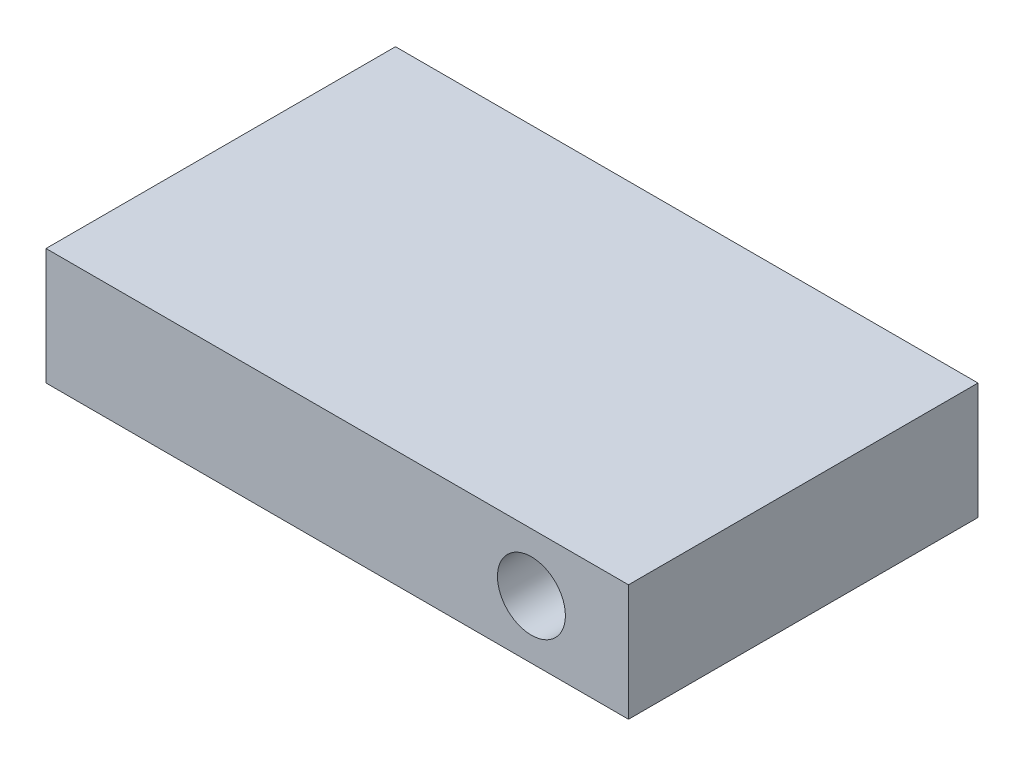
from build123d import *

# Parameters (mm, degrees)
SKETCH1_W          = 30
SKETCH1_H          = 18
EXTRUDE1_DEPTH     = 6
SKETCH2_R          = 1.75
CUT_EXTRUDE1_DEPTH = 36.496478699


with BuildPart() as part:
    # Sketch1 → Extrude1 (new body)
    with BuildSketch(Plane(origin=(0, 0, 0), x_dir=(1, 0, 0), z_dir=(0, 1, 0))):
        with Locations((15, 9)):
            Rectangle(SKETCH1_W, SKETCH1_H)
    extrude(amount=EXTRUDE1_DEPTH)

    # Sketch2 → Cut-Extrude1 (cut, through all)
    with BuildSketch(Plane.XY):
        with Locations((25, 3)):
            Circle(SKETCH2_R)
    extrude(amount=-CUT_EXTRUDE1_DEPTH, mode=Mode.SUBTRACT)


solid = part.part
